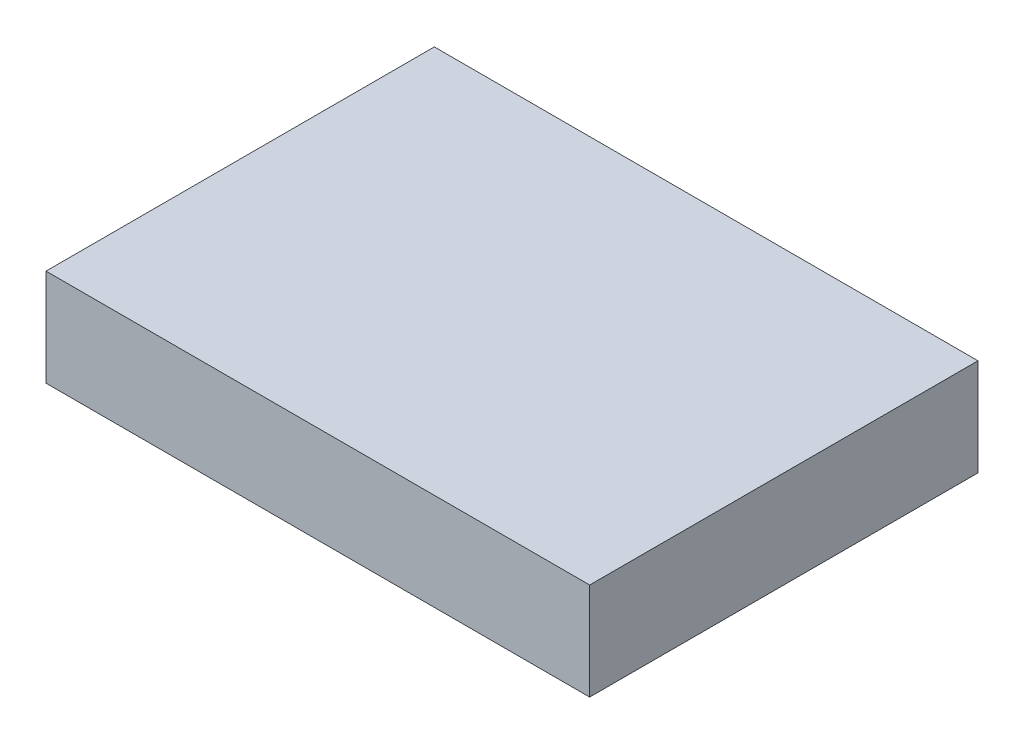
from build123d import *

# Parameters (mm, degrees)
SKETCH1_W           = 28
SKETCH1_H           = 20
BOSS_EXTRUDE1_DEPTH = 2.5


with BuildPart() as part:
    # Sketch1 → Boss-Extrude1 (new, symmetric)
    with BuildSketch(Plane(origin=(0, 0, 0), x_dir=(1, 0, 0), z_dir=(0, 1, 0))):
        Rectangle(SKETCH1_W, SKETCH1_H)
    extrude(amount=BOSS_EXTRUDE1_DEPTH, both=True)


solid = part.part
